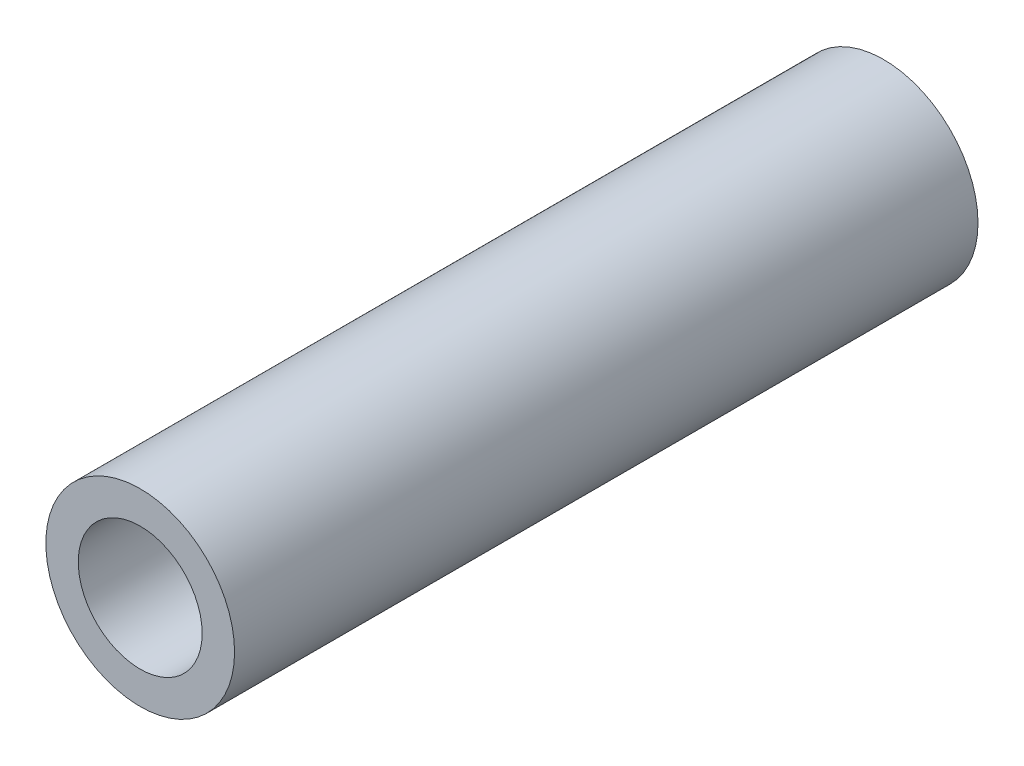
from build123d import *

# Parameters (mm, degrees)
ESQUISSE1_R        = 4.95
ESQUISSE1_R_2      = 3.25
BOSS_EXTRU_1_DEPTH = 39


with BuildPart() as part:
    # Esquisse1 → Boss.-Extru.1 (new body)
    with BuildSketch(Plane.XY):
        Circle(ESQUISSE1_R)
        Circle(ESQUISSE1_R_2, mode=Mode.SUBTRACT)
    extrude(amount=BOSS_EXTRU_1_DEPTH)


solid = part.part
